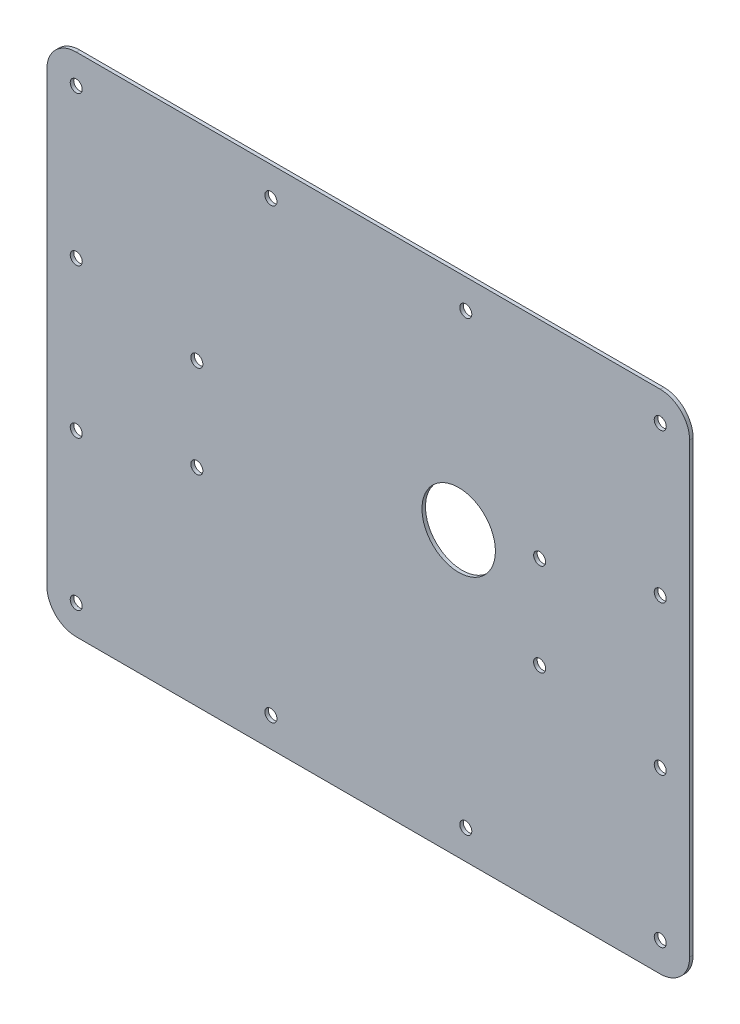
from build123d import *

# Parameters (mm, degrees)
SKETCH1_R           = 15.875
SKETCH1_R_2         = 2.6
BOSS_EXTRUDE1_DEPTH = 1.51892


with BuildPart() as part:
    # Sketch1 → Boss-Extrude1 (new body)
    with BuildSketch(Plane.XY):
        with BuildLine():
            Line((-126.238, 109.474), (126.238, 109.474))
            ThreePointArc((126.238, 109.474), (135.218256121, 105.754256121), (138.938, 96.774))
            Line((138.938, 96.774), (138.938, -96.774))
            ThreePointArc((138.938, -96.774), (135.218256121, -105.754256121), (126.238, -109.474))
            Line((126.238, -109.474), (-126.238, -109.474))
            ThreePointArc((-126.238, -109.474), (-135.218256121, -105.754256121), (-138.938, -96.774))
            Line((-138.938, -96.774), (-138.938, 96.774))
            ThreePointArc((-138.938, 96.774), (-135.218256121, 105.754256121), (-126.238, 109.474))
        make_face()
        with Locations((39.1, 13.2)):
            Circle(SKETCH1_R, mode=Mode.SUBTRACT)
        with Locations((-74.1, -20)):
            Circle(SKETCH1_R_2, mode=Mode.SUBTRACT)
        with Locations((74.1, -20)):
            Circle(SKETCH1_R_2, mode=Mode.SUBTRACT)
        with Locations((74.1, 20)):
            Circle(SKETCH1_R_2, mode=Mode.SUBTRACT)
        with Locations((-74.1, 20)):
            Circle(SKETCH1_R_2, mode=Mode.SUBTRACT)
        with Locations((-126.238, -96.774)):
            Circle(SKETCH1_R_2, mode=Mode.SUBTRACT)
        with Locations(Location((126.238, -96.774, 0), (0, 0, 180))):
            Circle(SKETCH1_R_2, mode=Mode.SUBTRACT)
        with Locations((126.238, 96.774)):
            Circle(SKETCH1_R_2, mode=Mode.SUBTRACT)
        with Locations(Location((-126.238, 96.774, 0), (0, 0, 180))):
            Circle(SKETCH1_R_2, mode=Mode.SUBTRACT)
        with Locations((-126.238, -32.258)):
            Circle(SKETCH1_R_2, mode=Mode.SUBTRACT)
        with Locations((-126.238, 32.258)):
            Circle(SKETCH1_R_2, mode=Mode.SUBTRACT)
        with Locations(Location((126.238, -32.258, 0), (0, 0, 180))):
            Circle(SKETCH1_R_2, mode=Mode.SUBTRACT)
        with Locations(Location((126.238, 32.258, 0), (0, 0, 180))):
            Circle(SKETCH1_R_2, mode=Mode.SUBTRACT)
        with Locations((-42.079333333, -96.774)):
            Circle(SKETCH1_R_2, mode=Mode.SUBTRACT)
        with Locations((42.164, -96.774)):
            Circle(SKETCH1_R_2, mode=Mode.SUBTRACT)
        with Locations(Location((42.164, 96.774, 0), (0, 0, 180))):
            Circle(SKETCH1_R_2, mode=Mode.SUBTRACT)
        with Locations(Location((-42.079333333, 96.774, 0), (0, 0, 180))):
            Circle(SKETCH1_R_2, mode=Mode.SUBTRACT)
    extrude(amount=BOSS_EXTRUDE1_DEPTH)


solid = part.part
